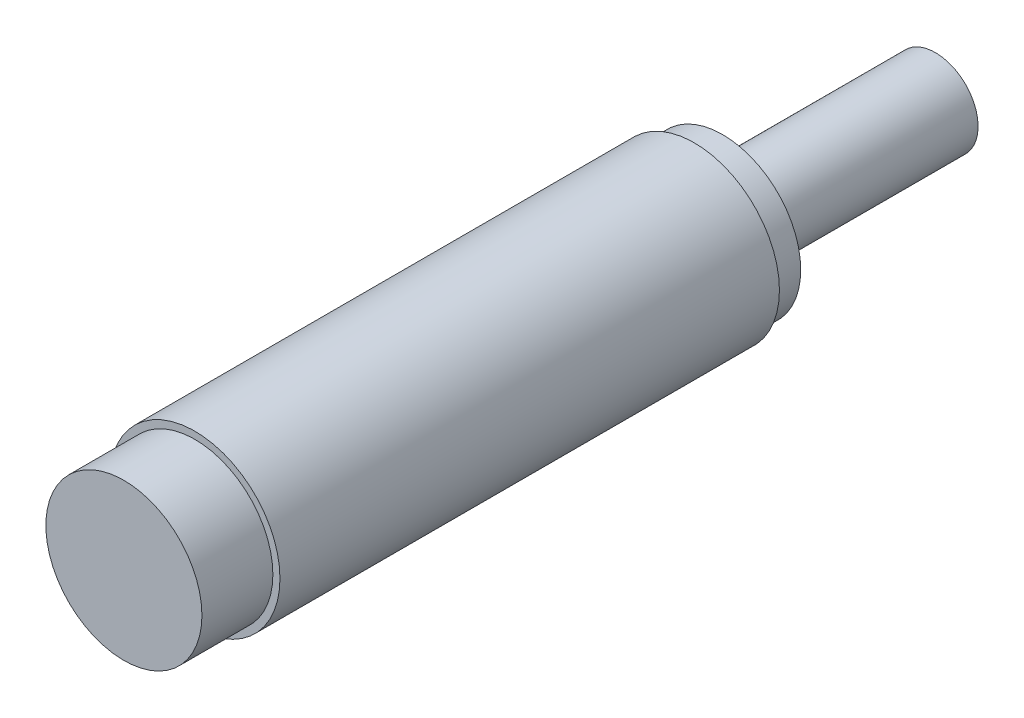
ISO-10303-21;
HEADER;
FILE_DESCRIPTION(('STEP AP214'),'2;1');
FILE_NAME('part.step','',(''),(''),'','','');
FILE_SCHEMA(('AUTOMOTIVE_DESIGN { 1 0 10303 214 1 1 1 1 }'));
ENDSEC;
DATA;
#1=APPLICATION_CONTEXT('core data for automotive mechanical design processes');
#2=APPLICATION_PROTOCOL_DEFINITION('international standard','automotive_design',2000,#1);
#3=PRODUCT_CONTEXT('',#1,'mechanical');
#4=PRODUCT('Part','Part','',(#3));
#5=PRODUCT_RELATED_PRODUCT_CATEGORY('part','',(#4));
#6=PRODUCT_DEFINITION_FORMATION('','',#4);
#7=PRODUCT_DEFINITION_CONTEXT('part definition',#1,'design');
#8=PRODUCT_DEFINITION('design','',#6,#7);
#9=PRODUCT_DEFINITION_SHAPE('','',#8);
#10=(LENGTH_UNIT() NAMED_UNIT(*) SI_UNIT(.MILLI.,.METRE.));
#11=(NAMED_UNIT(*) PLANE_ANGLE_UNIT() SI_UNIT($,.RADIAN.));
#12=(NAMED_UNIT(*) SI_UNIT($,.STERADIAN.) SOLID_ANGLE_UNIT());
#13=UNCERTAINTY_MEASURE_WITH_UNIT(LENGTH_MEASURE(1.E-05),#10,'distance_accuracy_value','');
#14=(GEOMETRIC_REPRESENTATION_CONTEXT(3) GLOBAL_UNCERTAINTY_ASSIGNED_CONTEXT((#13)) GLOBAL_UNIT_ASSIGNED_CONTEXT((#10,
#11,#12)) REPRESENTATION_CONTEXT('',''));
#15=CARTESIAN_POINT('',(0.,0.,0.));
#16=DIRECTION('',(0.,0.,1.));
#17=DIRECTION('',(1.,0.,0.));
#18=AXIS2_PLACEMENT_3D('',#15,#16,#17);
#19=CARTESIAN_POINT('',(0.,0.,-2.));
#20=DIRECTION('',(0.,0.,-1.));
#21=DIRECTION('',(-1.,0.,0.));
#22=AXIS2_PLACEMENT_3D('',#19,#20,#21);
#23=PLANE('',#22);
#24=CARTESIAN_POINT('',(0.,0.,-2.));
#25=DIRECTION('',(0.,0.,-1.));
#26=DIRECTION('',(-1.,0.,0.));
#27=AXIS2_PLACEMENT_3D('',#24,#25,#26);
#28=CIRCLE('',#27,5.5);
#29=CARTESIAN_POINT('',(-5.5,0.,-2.));
#30=VERTEX_POINT('',#29);
#31=EDGE_CURVE('E38',#30,#30,#28,.T.);
#32=ORIENTED_EDGE('',*,*,#31,.T.);
#33=EDGE_LOOP('',(#32));
#34=FACE_BOUND('',#33,.T.);
#35=CARTESIAN_POINT('',(0.,0.,-2.));
#36=DIRECTION('',(0.,0.,-1.));
#37=DIRECTION('',(-1.,0.,0.));
#38=AXIS2_PLACEMENT_3D('',#35,#36,#37);
#39=CIRCLE('',#38,3.);
#40=CARTESIAN_POINT('',(-3.,0.,-2.));
#41=VERTEX_POINT('',#40);
#42=EDGE_CURVE('E44',#41,#41,#39,.T.);
#43=ORIENTED_EDGE('',*,*,#42,.F.);
#44=EDGE_LOOP('',(#43));
#45=FACE_BOUND('',#44,.T.);
#46=ADVANCED_FACE('F15',(#34,#45),#23,.T.);
#47=CARTESIAN_POINT('',(0.,0.,0.));
#48=DIRECTION('',(0.,0.,1.));
#49=DIRECTION('',(1.,0.,0.));
#50=AXIS2_PLACEMENT_3D('',#47,#48,#49);
#51=PLANE('',#50);
#52=CARTESIAN_POINT('',(0.,0.,0.));
#53=DIRECTION('',(0.,0.,1.));
#54=DIRECTION('',(1.,0.,0.));
#55=AXIS2_PLACEMENT_3D('',#52,#53,#54);
#56=CIRCLE('',#55,6.);
#57=CARTESIAN_POINT('',(6.,0.,0.));
#58=VERTEX_POINT('',#57);
#59=EDGE_CURVE('E26',#58,#58,#56,.T.);
#60=ORIENTED_EDGE('',*,*,#59,.F.);
#61=EDGE_LOOP('',(#60));
#62=FACE_BOUND('',#61,.T.);
#63=CARTESIAN_POINT('',(0.,0.,0.));
#64=DIRECTION('',(0.,0.,1.));
#65=DIRECTION('',(1.,0.,0.));
#66=AXIS2_PLACEMENT_3D('',#63,#64,#65);
#67=CIRCLE('',#66,5.5);
#68=CARTESIAN_POINT('',(5.5,0.,0.));
#69=VERTEX_POINT('',#68);
#70=EDGE_CURVE('E10',#69,#69,#67,.F.);
#71=ORIENTED_EDGE('',*,*,#70,.F.);
#72=EDGE_LOOP('',(#71));
#73=FACE_BOUND('',#72,.T.);
#74=ADVANCED_FACE('F51',(#62,#73),#51,.F.);
#75=CARTESIAN_POINT('',(0.,0.,35.2));
#76=DIRECTION('',(0.,0.,1.));
#77=DIRECTION('',(1.,0.,0.));
#78=AXIS2_PLACEMENT_3D('',#75,#76,#77);
#79=PLANE('',#78);
#80=CARTESIAN_POINT('',(0.,0.,35.2));
#81=DIRECTION('',(0.,0.,1.));
#82=DIRECTION('',(1.,0.,0.));
#83=AXIS2_PLACEMENT_3D('',#80,#81,#82);
#84=CIRCLE('',#83,6.);
#85=CARTESIAN_POINT('',(6.,0.,35.2));
#86=VERTEX_POINT('',#85);
#87=EDGE_CURVE('E22',#86,#86,#84,.T.);
#88=ORIENTED_EDGE('',*,*,#87,.T.);
#89=EDGE_LOOP('',(#88));
#90=FACE_BOUND('',#89,.T.);
#91=CARTESIAN_POINT('',(0.,0.,35.2));
#92=DIRECTION('',(0.,0.,1.));
#93=DIRECTION('',(1.,0.,0.));
#94=AXIS2_PLACEMENT_3D('',#91,#92,#93);
#95=CIRCLE('',#94,5.5);
#96=CARTESIAN_POINT('',(5.5,0.,35.2));
#97=VERTEX_POINT('',#96);
#98=EDGE_CURVE('E35',#97,#97,#95,.T.);
#99=ORIENTED_EDGE('',*,*,#98,.F.);
#100=EDGE_LOOP('',(#99));
#101=FACE_BOUND('',#100,.T.);
#102=ADVANCED_FACE('F59',(#90,#101),#79,.T.);
#103=CARTESIAN_POINT('',(0.,0.,35.2));
#104=DIRECTION('',(0.,0.,-1.));
#105=DIRECTION('',(-1.,0.,0.));
#106=AXIS2_PLACEMENT_3D('',#103,#104,#105);
#107=CYLINDRICAL_SURFACE('',#106,6.);
#108=ORIENTED_EDGE('',*,*,#87,.F.);
#109=EDGE_LOOP('',(#108));
#110=FACE_BOUND('',#109,.T.);
#111=ORIENTED_EDGE('',*,*,#59,.T.);
#112=EDGE_LOOP('',(#111));
#113=FACE_BOUND('',#112,.T.);
#114=ADVANCED_FACE('F17',(#110,#113),#107,.T.);
#115=CARTESIAN_POINT('',(0.,0.,40.2));
#116=DIRECTION('',(0.,0.,-1.));
#117=DIRECTION('',(-1.,0.,0.));
#118=AXIS2_PLACEMENT_3D('',#115,#116,#117);
#119=CYLINDRICAL_SURFACE('',#118,5.5);
#120=CARTESIAN_POINT('',(0.,0.,40.2));
#121=DIRECTION('',(0.,0.,1.));
#122=DIRECTION('',(1.,0.,0.));
#123=AXIS2_PLACEMENT_3D('',#120,#121,#122);
#124=CIRCLE('',#123,5.5);
#125=CARTESIAN_POINT('',(5.5,0.,40.2));
#126=VERTEX_POINT('',#125);
#127=EDGE_CURVE('E30',#126,#126,#124,.T.);
#128=ORIENTED_EDGE('',*,*,#127,.F.);
#129=EDGE_LOOP('',(#128));
#130=FACE_BOUND('',#129,.T.);
#131=ORIENTED_EDGE('',*,*,#98,.T.);
#132=EDGE_LOOP('',(#131));
#133=FACE_BOUND('',#132,.T.);
#134=ADVANCED_FACE('F72',(#130,#133),#119,.T.);
#135=CARTESIAN_POINT('',(0.,0.,40.2));
#136=DIRECTION('',(0.,0.,1.));
#137=DIRECTION('',(1.,0.,0.));
#138=AXIS2_PLACEMENT_3D('',#135,#136,#137);
#139=PLANE('',#138);
#140=ORIENTED_EDGE('',*,*,#127,.T.);
#141=EDGE_LOOP('',(#140));
#142=FACE_BOUND('',#141,.T.);
#143=ADVANCED_FACE('F68',(#142),#139,.T.);
#144=CARTESIAN_POINT('',(0.,0.,-2.));
#145=DIRECTION('',(0.,0.,1.));
#146=DIRECTION('',(1.,0.,0.));
#147=AXIS2_PLACEMENT_3D('',#144,#145,#146);
#148=CYLINDRICAL_SURFACE('',#147,5.5);
#149=ORIENTED_EDGE('',*,*,#31,.F.);
#150=EDGE_LOOP('',(#149));
#151=FACE_BOUND('',#150,.T.);
#152=ORIENTED_EDGE('',*,*,#70,.T.);
#153=EDGE_LOOP('',(#152));
#154=FACE_BOUND('',#153,.T.);
#155=ADVANCED_FACE('F65',(#151,#154),#148,.T.);
#156=CARTESIAN_POINT('',(0.,0.,-17.));
#157=DIRECTION('',(0.,0.,1.));
#158=DIRECTION('',(1.,0.,0.));
#159=AXIS2_PLACEMENT_3D('',#156,#157,#158);
#160=CYLINDRICAL_SURFACE('',#159,3.);
#161=CARTESIAN_POINT('',(0.,0.,-17.));
#162=DIRECTION('',(0.,0.,-1.));
#163=DIRECTION('',(-1.,0.,0.));
#164=AXIS2_PLACEMENT_3D('',#161,#162,#163);
#165=CIRCLE('',#164,3.);
#166=CARTESIAN_POINT('',(-3.,0.,-17.));
#167=VERTEX_POINT('',#166);
#168=EDGE_CURVE('E41',#167,#167,#165,.T.);
#169=ORIENTED_EDGE('',*,*,#168,.F.);
#170=EDGE_LOOP('',(#169));
#171=FACE_BOUND('',#170,.T.);
#172=ORIENTED_EDGE('',*,*,#42,.T.);
#173=EDGE_LOOP('',(#172));
#174=FACE_BOUND('',#173,.T.);
#175=ADVANCED_FACE('F48',(#171,#174),#160,.T.);
#176=CARTESIAN_POINT('',(0.,0.,-17.));
#177=DIRECTION('',(0.,0.,-1.));
#178=DIRECTION('',(-1.,0.,0.));
#179=AXIS2_PLACEMENT_3D('',#176,#177,#178);
#180=PLANE('',#179);
#181=ORIENTED_EDGE('',*,*,#168,.T.);
#182=EDGE_LOOP('',(#181));
#183=FACE_BOUND('',#182,.T.);
#184=ADVANCED_FACE('F116',(#183),#180,.T.);
#185=CLOSED_SHELL('',(#46,#74,#102,#114,#134,#143,#155,#175,#184));
#186=MANIFOLD_SOLID_BREP('B1',#185);
#187=ADVANCED_BREP_SHAPE_REPRESENTATION('',(#18,#186),#14);
#188=SHAPE_DEFINITION_REPRESENTATION(#9,#187);
ENDSEC;
END-ISO-10303-21;
